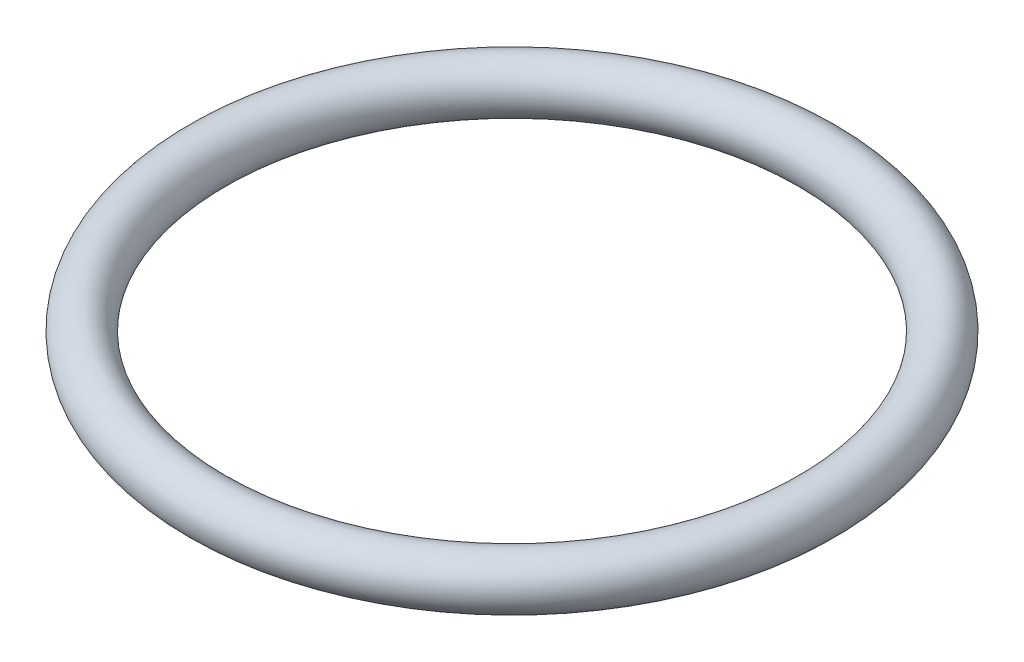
from build123d import *

# Parameters (mm, degrees)
SCHIZZO1_R = 1.31


with BuildPart() as part:
    # Schizzo1 → Rivoluzione1 (revolve)
    with BuildSketch(Plane.XY, mode=Mode.PRIVATE) as rivoluzione1_sk:
        with Locations((-15.76, 0)):
            Circle(SCHIZZO1_R)
    revolve(rivoluzione1_sk.sketch.rotate(Axis((0, 0, 0), (0, 1, 0)), 270), axis=Axis((0, 0, 0), (0, 1, 0)))


solid = part.part
